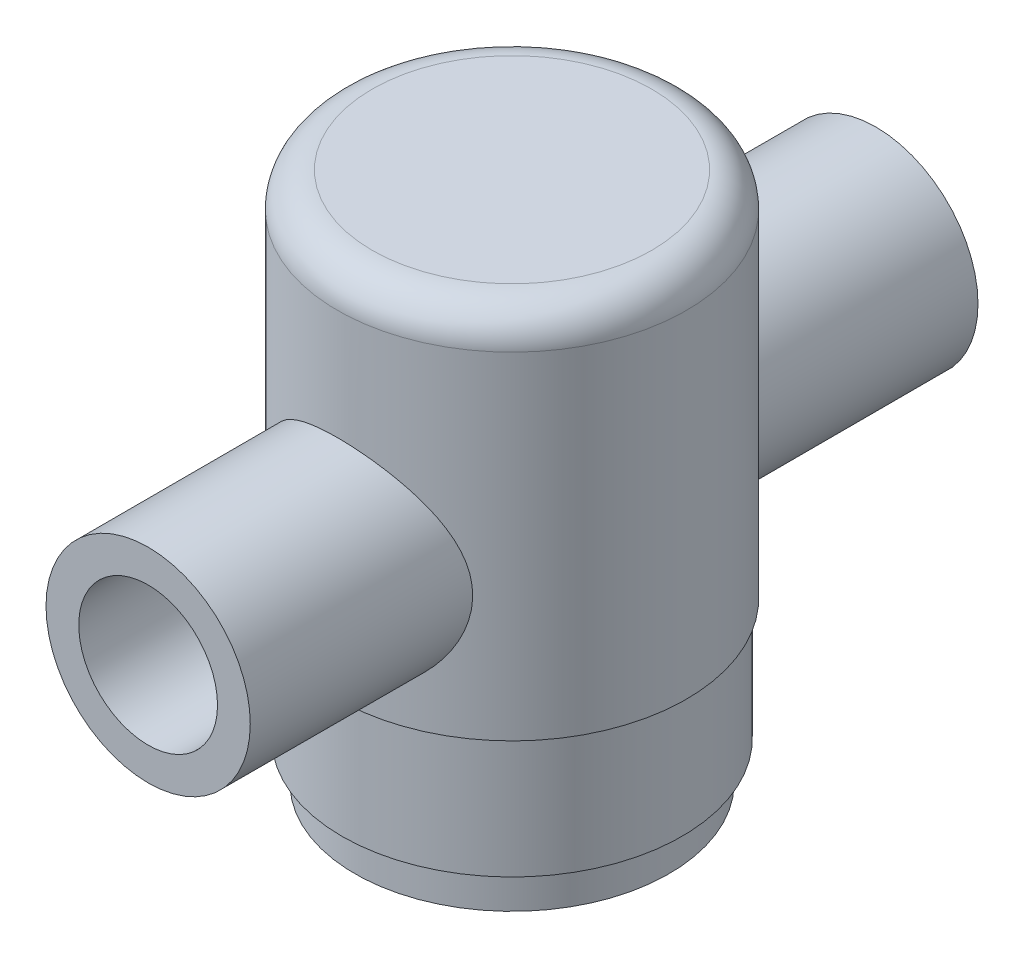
ISO-10303-21;
HEADER;
FILE_DESCRIPTION(('STEP AP214'),'2;1');
FILE_NAME('part.step','',(''),(''),'','','');
FILE_SCHEMA(('AUTOMOTIVE_DESIGN { 1 0 10303 214 1 1 1 1 }'));
ENDSEC;
DATA;
#1=APPLICATION_CONTEXT('core data for automotive mechanical design processes');
#2=APPLICATION_PROTOCOL_DEFINITION('international standard','automotive_design',2000,#1);
#3=PRODUCT_CONTEXT('',#1,'mechanical');
#4=PRODUCT('Part','Part','',(#3));
#5=PRODUCT_RELATED_PRODUCT_CATEGORY('part','',(#4));
#6=PRODUCT_DEFINITION_FORMATION('','',#4);
#7=PRODUCT_DEFINITION_CONTEXT('part definition',#1,'design');
#8=PRODUCT_DEFINITION('design','',#6,#7);
#9=PRODUCT_DEFINITION_SHAPE('','',#8);
#10=(LENGTH_UNIT() NAMED_UNIT(*) SI_UNIT(.MILLI.,.METRE.));
#11=(NAMED_UNIT(*) PLANE_ANGLE_UNIT() SI_UNIT($,.RADIAN.));
#12=(NAMED_UNIT(*) SI_UNIT($,.STERADIAN.) SOLID_ANGLE_UNIT());
#13=UNCERTAINTY_MEASURE_WITH_UNIT(LENGTH_MEASURE(1.E-05),#10,'distance_accuracy_value','');
#14=(GEOMETRIC_REPRESENTATION_CONTEXT(3) GLOBAL_UNCERTAINTY_ASSIGNED_CONTEXT((#13)) GLOBAL_UNIT_ASSIGNED_CONTEXT((#10,
#11,#12)) REPRESENTATION_CONTEXT('',''));
#15=CARTESIAN_POINT('',(0.,0.,0.));
#16=DIRECTION('',(0.,0.,1.));
#17=DIRECTION('',(1.,0.,0.));
#18=AXIS2_PLACEMENT_3D('',#15,#16,#17);
#19=CARTESIAN_POINT('',(0.,18.4404,-16.6497));
#20=DIRECTION('',(0.,0.,1.));
#21=DIRECTION('',(1.,0.,0.));
#22=AXIS2_PLACEMENT_3D('',#19,#20,#21);
#23=CYLINDRICAL_SURFACE('',#22,0.79375);
#24=CARTESIAN_POINT('',(0.,18.4404,8.5217));
#25=DIRECTION('',(0.,0.,1.));
#26=DIRECTION('',(1.,0.,0.));
#27=AXIS2_PLACEMENT_3D('',#24,#25,#26);
#28=CIRCLE('',#27,0.79375);
#29=CARTESIAN_POINT('',(0.79375,18.4404,8.5217));
#30=VERTEX_POINT('',#29);
#31=EDGE_CURVE('E108',#30,#30,#28,.F.);
#32=ORIENTED_EDGE('',*,*,#31,.F.);
#33=EDGE_LOOP('',(#32));
#34=FACE_BOUND('',#33,.T.);
#35=CARTESIAN_POINT('',(0.,18.4404,-8.5217));
#36=DIRECTION('',(0.,0.,-1.));
#37=DIRECTION('',(-1.,0.,0.));
#38=AXIS2_PLACEMENT_3D('',#35,#36,#37);
#39=CIRCLE('',#38,0.79375);
#40=CARTESIAN_POINT('',(-0.79375,18.4404,-8.5217));
#41=VERTEX_POINT('',#40);
#42=EDGE_CURVE('E49',#41,#41,#39,.F.);
#43=ORIENTED_EDGE('',*,*,#42,.F.);
#44=EDGE_LOOP('',(#43));
#45=FACE_BOUND('',#44,.T.);
#46=ADVANCED_FACE('F45',(#34,#45),#23,.F.);
#47=CARTESIAN_POINT('',(0.,0.,0.));
#48=DIRECTION('',(0.,-1.,0.));
#49=DIRECTION('',(0.,0.,-1.));
#50=AXIS2_PLACEMENT_3D('',#47,#48,#49);
#51=CYLINDRICAL_SURFACE('',#50,7.98195);
#52=CARTESIAN_POINT('',(-4.6736,18.4404,6.47062507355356));
#53=CARTESIAN_POINT('',(-4.67360004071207,18.3221364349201,6.47062498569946));
#54=CARTESIAN_POINT('',(-4.66910419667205,18.2038738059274,6.47387943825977));
#55=CARTESIAN_POINT('',(-4.65120218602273,17.9683806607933,6.48675295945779));
#56=CARTESIAN_POINT('',(-4.63779599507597,17.8511501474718,6.49637204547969));
#57=CARTESIAN_POINT('',(-4.60228279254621,17.6185893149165,6.52157891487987));
#58=CARTESIAN_POINT('',(-4.58016998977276,17.5032603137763,6.53717067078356));
#59=CARTESIAN_POINT('',(-4.52757619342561,17.275372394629,6.5737050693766));
#60=CARTESIAN_POINT('',(-4.49709128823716,17.1628147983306,6.59465021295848));
#61=CARTESIAN_POINT('',(-4.39414663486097,16.8319807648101,6.66407139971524));
#62=CARTESIAN_POINT('',(-4.30990350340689,16.61867871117,6.71935555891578));
#63=CARTESIAN_POINT('',(-4.1130541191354,16.2094761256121,6.84161373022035));
#64=CARTESIAN_POINT('',(-4.00043882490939,16.0135811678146,6.90859146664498));
#65=CARTESIAN_POINT('',(-3.73482652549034,15.6196963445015,7.05607999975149));
#66=CARTESIAN_POINT('',(-3.57866321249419,15.4240914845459,7.13725974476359));
#67=CARTESIAN_POINT('',(-3.23675681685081,15.0598188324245,7.29867295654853));
#68=CARTESIAN_POINT('',(-3.05099321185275,14.8911698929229,7.3789057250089));
#69=CARTESIAN_POINT('',(-2.74234453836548,14.6534138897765,7.49699393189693));
#70=CARTESIAN_POINT('',(-2.62865045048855,14.5735989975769,7.53770940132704));
#71=CARTESIAN_POINT('',(-2.39374084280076,14.4239444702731,7.61556380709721));
#72=CARTESIAN_POINT('',(-2.27252845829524,14.3541007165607,7.6527042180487));
#73=CARTESIAN_POINT('',(-2.02331400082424,14.2251400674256,7.72233531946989));
#74=CARTESIAN_POINT('',(-1.89531476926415,14.1660187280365,7.75482793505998));
#75=CARTESIAN_POINT('',(-1.63336897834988,14.0592316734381,7.81419561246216));
#76=CARTESIAN_POINT('',(-1.49942334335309,14.0115641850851,7.84107154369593));
#77=CARTESIAN_POINT('',(-1.23921777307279,13.9322249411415,7.88616942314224));
#78=CARTESIAN_POINT('',(-1.11338114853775,13.8994864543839,7.90495933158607));
#79=CARTESIAN_POINT('',(-0.858712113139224,13.844520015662,7.93666152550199));
#80=CARTESIAN_POINT('',(-0.729880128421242,13.8222905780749,7.94957464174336));
#81=CARTESIAN_POINT('',(-0.470425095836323,13.7886973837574,7.96913669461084));
#82=CARTESIAN_POINT('',(-0.339803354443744,13.7773260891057,7.97578997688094));
#83=CARTESIAN_POINT('',(-0.0779020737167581,13.7656117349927,7.9826443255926));
#84=CARTESIAN_POINT('',(0.0533774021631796,13.7652676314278,7.98284600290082));
#85=CARTESIAN_POINT('',(0.299796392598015,13.7749940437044,7.97715432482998));
#86=CARTESIAN_POINT('',(0.415003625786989,13.7838342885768,7.97198096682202));
#87=CARTESIAN_POINT('',(0.644163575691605,13.8099687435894,7.95674365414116));
#88=CARTESIAN_POINT('',(0.75811589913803,13.8272655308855,7.94667820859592));
#89=CARTESIAN_POINT('',(0.983905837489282,13.8700978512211,7.9218902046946));
#90=CARTESIAN_POINT('',(1.09574415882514,13.8956305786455,7.90716923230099));
#91=CARTESIAN_POINT('',(1.31665281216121,13.9546385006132,7.87340249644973));
#92=CARTESIAN_POINT('',(1.42572205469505,13.9881167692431,7.85435505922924));
#93=CARTESIAN_POINT('',(1.74930030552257,14.1004965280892,7.7910107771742));
#94=CARTESIAN_POINT('',(1.95871795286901,14.1910615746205,7.74067967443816));
#95=CARTESIAN_POINT('',(2.35957148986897,14.3998334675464,7.62807042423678));
#96=CARTESIAN_POINT('',(2.55100236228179,14.5180479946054,7.56578895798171));
#97=CARTESIAN_POINT('',(2.93445646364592,14.7943602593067,7.42608661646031));
#98=CARTESIAN_POINT('',(3.12395989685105,14.9554973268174,7.34774743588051));
#99=CARTESIAN_POINT('',(3.47479739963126,15.3051402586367,7.18850055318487));
#100=CARTESIAN_POINT('',(3.63609469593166,15.4936812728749,7.10758965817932));
#101=CARTESIAN_POINT('',(3.94351527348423,15.9171696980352,6.9421762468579));
#102=CARTESIAN_POINT('',(4.08614051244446,16.1549273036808,6.8582234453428));
#103=CARTESIAN_POINT('',(4.26786082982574,16.5306198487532,6.74551760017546));
#104=CARTESIAN_POINT('',(4.32305566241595,16.6589949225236,6.71015950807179));
#105=CARTESIAN_POINT('',(4.42210257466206,16.9214482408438,6.6453004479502));
#106=CARTESIAN_POINT('',(4.46595886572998,17.0555243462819,6.61579730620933));
#107=CARTESIAN_POINT('',(4.56137614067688,17.3998326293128,6.55059793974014));
#108=CARTESIAN_POINT('',(4.60500912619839,17.6132851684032,6.51970787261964));
#109=CARTESIAN_POINT('',(4.66203059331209,18.0459900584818,6.47906429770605));
#110=CARTESIAN_POINT('',(4.67545099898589,18.2652360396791,6.4692884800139));
#111=CARTESIAN_POINT('',(4.67133536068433,18.7034992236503,6.47226042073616));
#112=CARTESIAN_POINT('',(4.6537697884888,18.9225160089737,6.4850296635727));
#113=CARTESIAN_POINT('',(4.58866351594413,19.3538392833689,6.531249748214));
#114=CARTESIAN_POINT('',(4.54110001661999,19.5661405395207,6.56471631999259));
#115=CARTESIAN_POINT('',(4.41793404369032,19.9803411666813,6.64822473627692));
#116=CARTESIAN_POINT('',(4.34215958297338,20.1821678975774,6.69836804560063));
#117=CARTESIAN_POINT('',(4.16519394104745,20.5709807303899,6.80981611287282));
#118=CARTESIAN_POINT('',(4.06399277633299,20.7579609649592,6.87112525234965));
#119=CARTESIAN_POINT('',(3.81880485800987,21.1460850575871,7.01080926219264));
#120=CARTESIAN_POINT('',(3.67044176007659,21.3440615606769,7.09029980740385));
#121=CARTESIAN_POINT('',(3.34435183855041,21.7143446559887,7.2498108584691));
#122=CARTESIAN_POINT('',(3.16659873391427,21.8866280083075,7.32983177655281));
#123=CARTESIAN_POINT('',(2.86916511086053,22.1322166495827,7.4493381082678));
#124=CARTESIAN_POINT('',(2.75856981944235,22.2155978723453,7.49109884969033));
#125=CARTESIAN_POINT('',(2.52963889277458,22.3726658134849,7.57146905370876));
#126=CARTESIAN_POINT('',(2.41130627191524,22.4463562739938,7.6100797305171));
#127=CARTESIAN_POINT('',(2.16756019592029,22.5833166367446,7.68305876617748));
#128=CARTESIAN_POINT('',(2.04214897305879,22.6465897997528,7.71742845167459));
#129=CARTESIAN_POINT('',(1.78502078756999,22.7619836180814,7.78092226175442));
#130=CARTESIAN_POINT('',(1.65330470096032,22.8141058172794,7.81004711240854));
#131=CARTESIAN_POINT('',(1.39503354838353,22.9028643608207,7.860110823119));
#132=CARTESIAN_POINT('',(1.2688731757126,22.9403895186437,7.8815100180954));
#133=CARTESIAN_POINT('',(1.01303226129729,23.0047943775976,7.91845867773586));
#134=CARTESIAN_POINT('',(0.883352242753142,23.0316756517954,7.93400900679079));
#135=CARTESIAN_POINT('',(0.621686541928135,23.0743618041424,7.95878689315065));
#136=CARTESIAN_POINT('',(0.489702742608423,23.0901753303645,7.96801938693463));
#137=CARTESIAN_POINT('',(0.224577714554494,23.1104932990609,7.97989291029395));
#138=CARTESIAN_POINT('',(0.0914366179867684,23.1149990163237,7.98253468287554));
#139=CARTESIAN_POINT('',(-0.158040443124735,23.1127784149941,7.98123496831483));
#140=CARTESIAN_POINT('',(-0.274395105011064,23.107386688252,7.97807569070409));
#141=CARTESIAN_POINT('',(-0.506170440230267,23.0879645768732,7.96672975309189));
#142=CARTESIAN_POINT('',(-0.621590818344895,23.0739315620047,7.9585415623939));
#143=CARTESIAN_POINT('',(-0.850590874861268,23.0374062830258,7.93733162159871));
#144=CARTESIAN_POINT('',(-0.964171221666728,23.01491716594,7.9243116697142));
#145=CARTESIAN_POINT('',(-1.18879335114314,22.9617550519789,7.89374278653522));
#146=CARTESIAN_POINT('',(-1.29983413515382,22.9310788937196,7.87619210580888));
#147=CARTESIAN_POINT('',(-1.62655346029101,22.8277327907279,7.81757099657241));
#148=CARTESIAN_POINT('',(-1.8375948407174,22.743457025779,7.77035889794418));
#149=CARTESIAN_POINT('',(-2.24258401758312,22.5469974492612,7.66331350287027));
#150=CARTESIAN_POINT('',(-2.4365275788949,22.4348067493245,7.60347709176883));
#151=CARTESIAN_POINT('',(-2.8248419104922,22.171841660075,7.46850167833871));
#152=CARTESIAN_POINT('',(-3.01692419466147,22.0181842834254,7.392403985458));
#153=CARTESIAN_POINT('',(-3.37417479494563,21.6834662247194,7.23633338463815));
#154=CARTESIAN_POINT('',(-3.539311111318,21.502373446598,7.1563560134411));
#155=CARTESIAN_POINT('',(-3.77338055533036,21.2013433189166,7.03435170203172));
#156=CARTESIAN_POINT('',(-3.85259263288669,21.0897168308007,6.99116297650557));
#157=CARTESIAN_POINT('',(-4.00131123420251,20.8592526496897,6.9071209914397));
#158=CARTESIAN_POINT('',(-4.07081531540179,20.7404131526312,6.86626832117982));
#159=CARTESIAN_POINT('',(-4.19944988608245,20.4961716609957,6.78835788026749));
#160=CARTESIAN_POINT('',(-4.25858781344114,20.3707744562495,6.75129739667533));
#161=CARTESIAN_POINT('',(-4.36586332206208,20.1140497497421,6.68242680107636));
#162=CARTESIAN_POINT('',(-4.41400886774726,19.9827266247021,6.65061289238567));
#163=CARTESIAN_POINT('',(-4.49182500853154,19.7365201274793,6.5982471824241));
#164=CARTESIAN_POINT('',(-4.5232217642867,19.622391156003,6.57670694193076));
#165=CARTESIAN_POINT('',(-4.57738570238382,19.3912687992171,6.53912497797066));
#166=CARTESIAN_POINT('',(-4.60015788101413,19.2742771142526,6.52308007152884));
#167=CARTESIAN_POINT('',(-4.6367270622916,19.0383414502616,6.4971372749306));
#168=CARTESIAN_POINT('',(-4.65053320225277,18.9193995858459,6.48723312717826));
#169=CARTESIAN_POINT('',(-4.66896960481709,18.6804381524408,6.4739771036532));
#170=CARTESIAN_POINT('',(-4.67359995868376,18.5604185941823,6.4706251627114));
#171=CARTESIAN_POINT('',(-4.6736,18.4404,6.47062507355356));
#172=B_SPLINE_CURVE_WITH_KNOTS('',3,(#52,#53,#54,#55,#56,#57,#58,#59,#60,#61,#62,#63,#64,#65,
#66,#67,#68,#69,#70,#71,#72,#73,#74,#75,#76,#77,#78,#79,#80,#81,#82,#83,#84,#85,#86,#87,#88,#89,
#90,#91,#92,#93,#94,#95,#96,#97,#98,#99,#100,#101,#102,#103,#104,#105,#106,#107,#108,#109,#110,
#111,#112,#113,#114,#115,#116,#117,#118,#119,#120,#121,#122,#123,#124,#125,#126,#127,#128,#129,
#130,#131,#132,#133,#134,#135,#136,#137,#138,#139,#140,#141,#142,#143,#144,#145,#146,#147,#148,
#149,#150,#151,#152,#153,#154,#155,#156,#157,#158,#159,#160,#161,#162,#163,#164,#165,#166,#167,
#168,#169,#170,#171),.UNSPECIFIED.,.T.,.F.,(4,2,2,2,2,2,2,2,2,2,2,2,2,2,2,2,2,2,2,2,2,2,2,2,2,2,
2,2,2,2,2,2,2,2,2,2,2,2,2,2,2,2,2,2,2,2,2,2,2,2,2,2,2,2,2,2,2,2,2,4),(0.,0.354660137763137,
0.70932124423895,1.06421865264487,1.41928215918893,2.12378075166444,2.82850413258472,
3.6148461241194,4.40173569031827,4.8355139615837,5.26911253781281,5.70253099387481,
6.13588231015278,6.52945028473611,6.92296260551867,7.31620154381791,7.70940324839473,
8.05597361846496,8.40264967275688,8.74920775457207,9.09590013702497,9.79372697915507,
10.4917478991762,11.2709399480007,12.0511404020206,12.9152569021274,13.3471160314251,
13.7788145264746,14.4358563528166,15.0922035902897,15.7491766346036,16.4066495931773,
17.0681982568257,17.7300070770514,18.5065903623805,19.2838718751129,19.7173851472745,
20.1507305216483,20.5839399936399,21.0170894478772,21.4165691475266,21.815989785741,
22.2150979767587,22.614161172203,22.9633024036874,23.3125499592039,23.6616676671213,
24.010920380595,24.7040976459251,25.3974461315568,26.1668782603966,26.9372175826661,
27.3673587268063,27.7976079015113,28.2275470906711,28.6571737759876,29.0176775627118,
29.37797218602,29.7378990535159,30.0978223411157),.UNSPECIFIED.);
#173=CARTESIAN_POINT('',(-4.6736,18.4404,6.47062507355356));
#174=VERTEX_POINT('',#173);
#175=EDGE_CURVE('E55',#174,#174,#172,.T.);
#176=ORIENTED_EDGE('',*,*,#175,.F.);
#177=EDGE_LOOP('',(#176));
#178=FACE_BOUND('',#177,.T.);
#179=CARTESIAN_POINT('',(0.,28.1559,0.));
#180=DIRECTION('',(0.,-1.,0.));
#181=DIRECTION('',(0.,0.,-1.));
#182=AXIS2_PLACEMENT_3D('',#179,#180,#181);
#183=CIRCLE('',#182,7.98195);
#184=CARTESIAN_POINT('',(0.,28.1559,-7.98195));
#185=VERTEX_POINT('',#184);
#186=EDGE_CURVE('E229',#185,#185,#183,.T.);
#187=ORIENTED_EDGE('',*,*,#186,.T.);
#188=EDGE_LOOP('',(#187));
#189=FACE_BOUND('',#188,.T.);
#190=CARTESIAN_POINT('',(0.,12.7508,0.));
#191=DIRECTION('',(0.,-1.,0.));
#192=DIRECTION('',(0.,0.,-1.));
#193=AXIS2_PLACEMENT_3D('',#190,#191,#192);
#194=CIRCLE('',#193,7.98195);
#195=CARTESIAN_POINT('',(0.,12.7508,-7.98195));
#196=VERTEX_POINT('',#195);
#197=EDGE_CURVE('E237',#196,#196,#194,.T.);
#198=ORIENTED_EDGE('',*,*,#197,.F.);
#199=EDGE_LOOP('',(#198));
#200=FACE_BOUND('',#199,.T.);
#201=CARTESIAN_POINT('',(0.,23.114,-7.98195));
#202=CARTESIAN_POINT('',(0.120058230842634,23.1139991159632,-7.98194919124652));
#203=CARTESIAN_POINT('',(0.240160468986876,23.1093661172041,-7.97923403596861));
#204=CARTESIAN_POINT('',(0.479466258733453,23.0908912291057,-7.96843791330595));
#205=CARTESIAN_POINT('',(0.598669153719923,23.0770431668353,-7.96035334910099));
#206=CARTESIAN_POINT('',(0.835463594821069,23.0402827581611,-7.93899778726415));
#207=CARTESIAN_POINT('',(0.953051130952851,23.0173510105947,-7.92571568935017));
#208=CARTESIAN_POINT('',(1.18554863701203,22.9627093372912,-7.8942872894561));
#209=CARTESIAN_POINT('',(1.30045743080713,22.9309956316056,-7.87613889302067));
#210=CARTESIAN_POINT('',(1.52619456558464,22.8593602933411,-7.83551735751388));
#211=CARTESIAN_POINT('',(1.63704163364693,22.8194840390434,-7.81306817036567));
#212=CARTESIAN_POINT('',(1.8547005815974,22.7318340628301,-7.76428203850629));
#213=CARTESIAN_POINT('',(1.96151090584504,22.6840573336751,-7.73794361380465));
#214=CARTESIAN_POINT('',(2.27488821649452,22.5296009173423,-7.65395591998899));
#215=CARTESIAN_POINT('',(2.47470490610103,22.4116974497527,-7.59127735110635));
#216=CARTESIAN_POINT('',(2.86686163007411,22.1397037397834,-7.45245907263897));
#217=CARTESIAN_POINT('',(3.05753965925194,21.9835739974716,-7.37566483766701));
#218=CARTESIAN_POINT('',(3.41165149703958,21.6440559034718,-7.21870630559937));
#219=CARTESIAN_POINT('',(3.57505086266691,21.4606336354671,-7.13853790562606));
#220=CARTESIAN_POINT('',(3.88901802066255,21.0467671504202,-6.97295197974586));
#221=CARTESIAN_POINT('',(4.03592680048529,20.8133390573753,-6.88799690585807));
#222=CARTESIAN_POINT('',(4.28783383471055,20.3201257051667,-6.73408486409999));
#223=CARTESIAN_POINT('',(4.39289807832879,20.0603827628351,-6.66510277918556));
#224=CARTESIAN_POINT('',(4.53687962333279,19.5832875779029,-6.56764719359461));
#225=CARTESIAN_POINT('',(4.58547409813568,19.3700189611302,-6.53349541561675));
#226=CARTESIAN_POINT('',(4.65233909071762,18.9365985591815,-6.48606335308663));
#227=CARTESIAN_POINT('',(4.6706445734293,18.7164550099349,-6.47275900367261));
#228=CARTESIAN_POINT('',(4.67589766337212,18.2752332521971,-6.46896620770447));
#229=CARTESIAN_POINT('',(4.66279382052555,18.0541541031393,-6.47851519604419));
#230=CARTESIAN_POINT('',(4.60592730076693,17.6179454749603,-6.51905811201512));
#231=CARTESIAN_POINT('',(4.56214254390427,17.4028203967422,-6.55006748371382));
#232=CARTESIAN_POINT('',(4.44663190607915,16.9855645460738,-6.62901016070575));
#233=CARTESIAN_POINT('',(4.37513361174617,16.7833431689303,-6.67680532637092));
#234=CARTESIAN_POINT('',(4.20673493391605,16.3931782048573,-6.78416178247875));
#235=CARTESIAN_POINT('',(4.10982502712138,16.2052400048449,-6.84372748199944));
#236=CARTESIAN_POINT('',(3.87464709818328,15.815560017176,-6.97997474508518));
#237=CARTESIAN_POINT('',(3.73217033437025,15.6167799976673,-7.05785196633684));
#238=CARTESIAN_POINT('',(3.41822599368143,15.2438887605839,-7.21512724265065));
#239=CARTESIAN_POINT('',(3.24673216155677,15.0698001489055,-7.29452661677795));
#240=CARTESIAN_POINT('',(2.95813994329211,14.8195003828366,-7.41442305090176));
#241=CARTESIAN_POINT('',(2.8499601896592,14.7337279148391,-7.45677693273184));
#242=CARTESIAN_POINT('',(2.62573809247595,14.5716594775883,-7.53865008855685));
#243=CARTESIAN_POINT('',(2.50969890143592,14.4953597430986,-7.5781704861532));
#244=CARTESIAN_POINT('',(2.27032768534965,14.3529130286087,-7.65329198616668));
#245=CARTESIAN_POINT('',(2.14699514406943,14.2867667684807,-7.68889281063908));
#246=CARTESIAN_POINT('',(1.89385935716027,14.1654127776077,-7.75512215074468));
#247=CARTESIAN_POINT('',(1.76406013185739,14.1101983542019,-7.78575370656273));
#248=CARTESIAN_POINT('',(1.50764938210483,14.0146806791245,-7.83929348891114));
#249=CARTESIAN_POINT('',(1.38139394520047,13.9736332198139,-7.86257830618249));
#250=CARTESIAN_POINT('',(1.12502995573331,13.9022799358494,-7.90333246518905));
#251=CARTESIAN_POINT('',(0.994923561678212,13.8719682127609,-7.92080499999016));
#252=CARTESIAN_POINT('',(0.731997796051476,13.8225436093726,-7.94941383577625));
#253=CARTESIAN_POINT('',(0.599180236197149,13.8034234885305,-7.96055423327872));
#254=CARTESIAN_POINT('',(0.332009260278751,13.7766757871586,-7.97616404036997));
#255=CARTESIAN_POINT('',(0.197656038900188,13.7690467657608,-7.98063428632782));
#256=CARTESIAN_POINT('',(-0.0539294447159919,13.7656423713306,-7.98262799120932));
#257=CARTESIAN_POINT('',(-0.171139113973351,13.7684674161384,-7.9809716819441));
#258=CARTESIAN_POINT('',(-0.404869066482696,13.7828973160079,-7.97253319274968));
#259=CARTESIAN_POINT('',(-0.521389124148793,13.7945048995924,-7.96574941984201));
#260=CARTESIAN_POINT('',(-0.752797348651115,13.826349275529,-7.94721862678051));
#261=CARTESIAN_POINT('',(-0.867686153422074,13.8465825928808,-7.93547360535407));
#262=CARTESIAN_POINT('',(-1.09510078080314,13.8954201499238,-7.90730300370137));
#263=CARTESIAN_POINT('',(-1.20762567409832,13.924027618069,-7.89087561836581));
#264=CARTESIAN_POINT('',(-1.53670571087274,14.0208256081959,-7.8357378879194));
#265=CARTESIAN_POINT('',(-1.74895132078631,14.1005858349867,-7.79081481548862));
#266=CARTESIAN_POINT('',(-2.15697740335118,14.2882256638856,-7.6878745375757));
#267=CARTESIAN_POINT('',(-2.3527542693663,14.3961114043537,-7.62985447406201));
#268=CARTESIAN_POINT('',(-2.74447752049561,14.6495813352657,-7.49842169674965));
#269=CARTESIAN_POINT('',(-2.93831246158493,14.7979236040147,-7.42403475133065));
#270=CARTESIAN_POINT('',(-3.29982499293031,15.1218571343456,-7.27058142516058));
#271=CARTESIAN_POINT('',(-3.4674716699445,15.2974801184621,-7.19150966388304));
#272=CARTESIAN_POINT('',(-3.79263088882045,15.6958821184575,-7.02599484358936));
#273=CARTESIAN_POINT('',(-3.9464646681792,15.9217955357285,-6.93981708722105));
#274=CARTESIAN_POINT('',(-4.21384413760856,16.4005498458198,-6.78080473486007));
#275=CARTESIAN_POINT('',(-4.32743867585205,16.6533576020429,-6.70795401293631));
#276=CARTESIAN_POINT('',(-4.48957165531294,17.1235584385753,-6.60019992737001));
#277=CARTESIAN_POINT('',(-4.54685775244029,17.3368272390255,-6.56050072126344));
#278=CARTESIAN_POINT('',(-4.63083740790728,17.7719514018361,-6.50150580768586));
#279=CARTESIAN_POINT('',(-4.65756961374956,17.9937955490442,-6.48218432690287));
#280=CARTESIAN_POINT('',(-4.67895955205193,18.4404943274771,-6.46676646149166));
#281=CARTESIAN_POINT('',(-4.67352703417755,18.6653556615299,-6.47073542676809));
#282=CARTESIAN_POINT('',(-4.63072259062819,19.1104788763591,-6.50142869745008));
#283=CARTESIAN_POINT('',(-4.59333139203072,19.3307378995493,-6.52816673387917));
#284=CARTESIAN_POINT('',(-4.49037668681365,19.7537952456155,-6.59937531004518));
#285=CARTESIAN_POINT('',(-4.42574423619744,19.9569257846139,-6.64325659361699));
#286=CARTESIAN_POINT('',(-4.2709877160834,20.3498049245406,-6.74378776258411));
#287=CARTESIAN_POINT('',(-4.18085402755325,20.5395484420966,-6.80044246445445));
#288=CARTESIAN_POINT('',(-3.96159545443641,20.9316455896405,-6.93079745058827));
#289=CARTESIAN_POINT('',(-3.8285930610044,21.1313979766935,-7.00577870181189));
#290=CARTESIAN_POINT('',(-3.5342368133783,21.5077771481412,-7.15878410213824));
#291=CARTESIAN_POINT('',(-3.37286053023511,21.6843854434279,-7.23681062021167));
#292=CARTESIAN_POINT('',(-3.09894391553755,21.9415118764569,-7.35662650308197));
#293=CARTESIAN_POINT('',(-2.99504430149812,22.0308165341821,-7.39963867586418));
#294=CARTESIAN_POINT('',(-2.77923902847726,22.2003439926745,-7.48336354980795));
#295=CARTESIAN_POINT('',(-2.66733631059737,22.2805701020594,-7.52407708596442));
#296=CARTESIAN_POINT('',(-2.43594332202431,22.4313655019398,-7.60214650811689));
#297=CARTESIAN_POINT('',(-2.31644657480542,22.5019263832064,-7.6394994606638));
#298=CARTESIAN_POINT('',(-2.07067543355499,22.6325581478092,-7.70974363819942));
#299=CARTESIAN_POINT('',(-1.94440503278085,22.6926351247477,-7.74263745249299));
#300=CARTESIAN_POINT('',(-1.69166789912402,22.7991555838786,-7.8016577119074));
#301=CARTESIAN_POINT('',(-1.56546358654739,22.8460894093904,-7.82802138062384));
#302=CARTESIAN_POINT('',(-1.3085656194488,22.9290966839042,-7.87503753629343));
#303=CARTESIAN_POINT('',(-1.17787462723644,22.9651764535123,-7.89569334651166));
#304=CARTESIAN_POINT('',(-0.913446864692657,23.0258662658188,-7.93062896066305));
#305=CARTESIAN_POINT('',(-0.779720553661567,23.0505108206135,-7.9449279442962));
#306=CARTESIAN_POINT('',(-0.510162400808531,23.0880615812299,-7.96677545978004));
#307=CARTESIAN_POINT('',(-0.374332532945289,23.1009781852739,-7.97432997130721));
#308=CARTESIAN_POINT('',(-0.198510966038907,23.1099514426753,-7.97958012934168));
#309=CARTESIAN_POINT('',(-0.15883105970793,23.1114691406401,-7.98046836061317));
#310=CARTESIAN_POINT('',(-0.0794357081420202,23.1134935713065,-7.98165343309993));
#311=CARTESIAN_POINT('',(-0.0397202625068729,23.1140002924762,-7.98195026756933));
#312=CARTESIAN_POINT('',(0.,23.114,-7.98195));
#313=B_SPLINE_CURVE_WITH_KNOTS('',3,(#201,#202,#203,#204,#205,#206,#207,#208,#209,#210,#211,
#212,#213,#214,#215,#216,#217,#218,#219,#220,#221,#222,#223,#224,#225,#226,#227,#228,#229,#230,
#231,#232,#233,#234,#235,#236,#237,#238,#239,#240,#241,#242,#243,#244,#245,#246,#247,#248,#249,
#250,#251,#252,#253,#254,#255,#256,#257,#258,#259,#260,#261,#262,#263,#264,#265,#266,#267,#268,
#269,#270,#271,#272,#273,#274,#275,#276,#277,#278,#279,#280,#281,#282,#283,#284,#285,#286,#287,
#288,#289,#290,#291,#292,#293,#294,#295,#296,#297,#298,#299,#300,#301,#302,#303,#304,#305,#306,
#307,#308,#309,#310,#311,#312),.UNSPECIFIED.,.T.,.F.,(4,2,2,2,2,2,2,2,2,2,2,2,2,2,2,2,2,2,2,2,2,
2,2,2,2,2,2,2,2,2,2,2,2,2,2,2,2,2,2,2,2,2,2,2,2,2,2,2,2,2,2,2,2,2,2,4),(0.,0.3601318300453,
0.720505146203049,1.08165234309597,1.44295522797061,1.80230155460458,2.16178497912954,
2.879791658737,3.65121195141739,4.42359901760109,5.28515367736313,6.14534422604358,
6.80665648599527,7.46720480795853,8.12883588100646,8.79094359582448,9.44772542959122,
10.1047537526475,10.8718480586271,11.6396401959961,12.0723946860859,12.5049766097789,
12.9375891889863,13.3699360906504,13.7737149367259,14.1772715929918,14.5805668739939,
14.9838115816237,15.3351431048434,15.6865838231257,16.037883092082,16.3893179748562,
17.0796162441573,17.7700652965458,18.5325174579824,19.2958629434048,20.1515433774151,
21.0061814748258,21.6764629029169,22.3458955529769,23.0172074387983,23.6889244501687,
24.3393388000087,24.9899988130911,25.7414720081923,26.4935419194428,26.9238863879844,
27.3540735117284,27.7846325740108,28.2149405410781,28.6259634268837,29.0367464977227,
29.4462816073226,29.8554532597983,29.9745985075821,30.0937451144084),.UNSPECIFIED.);
#314=CARTESIAN_POINT('',(0.,23.114,-7.98195));
#315=VERTEX_POINT('',#314);
#316=EDGE_CURVE('E10',#315,#315,#313,.T.);
#317=ORIENTED_EDGE('',*,*,#316,.F.);
#318=EDGE_LOOP('',(#317));
#319=FACE_BOUND('',#318,.T.);
#320=ADVANCED_FACE('F78',(#178,#189,#200,#319),#51,.T.);
#321=CARTESIAN_POINT('',(0.,0.,0.));
#322=DIRECTION('',(0.,-1.,0.));
#323=DIRECTION('',(0.,0.,-1.));
#324=AXIS2_PLACEMENT_3D('',#321,#322,#323);
#325=CYLINDRICAL_SURFACE('',#324,3.175);
#326=CARTESIAN_POINT('',(0.,5.4356,0.));
#327=DIRECTION('',(0.,-1.,0.));
#328=DIRECTION('',(0.,0.,-1.));
#329=AXIS2_PLACEMENT_3D('',#326,#327,#328);
#330=CIRCLE('',#329,3.175);
#331=CARTESIAN_POINT('',(0.,5.4356,-3.175));
#332=VERTEX_POINT('',#331);
#333=EDGE_CURVE('E178',#332,#332,#330,.T.);
#334=ORIENTED_EDGE('',*,*,#333,.T.);
#335=EDGE_LOOP('',(#334));
#336=FACE_BOUND('',#335,.T.);
#337=CARTESIAN_POINT('',(0.,13.7668,-3.175));
#338=CARTESIAN_POINT('',(0.158846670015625,13.7668060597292,-3.1749933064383));
#339=CARTESIAN_POINT('',(0.31773754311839,13.7749721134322,-3.16300759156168));
#340=CARTESIAN_POINT('',(0.630446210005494,13.8068443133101,-3.11580182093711));
#341=CARTESIAN_POINT('',(0.784260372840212,13.8305613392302,-3.08056549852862));
#342=CARTESIAN_POINT('',(1.08179669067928,13.8912005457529,-2.98905816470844));
#343=CARTESIAN_POINT('',(1.22556404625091,13.9280583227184,-2.93288968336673));
#344=CARTESIAN_POINT('',(1.5010029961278,14.0120493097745,-2.8019452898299));
#345=CARTESIAN_POINT('',(1.63267324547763,14.0591836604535,-2.72716731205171));
#346=CARTESIAN_POINT('',(1.89302097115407,14.1648408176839,-2.55413457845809));
#347=CARTESIAN_POINT('',(2.02046047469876,14.2239952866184,-2.45441108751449));
#348=CARTESIAN_POINT('',(2.2579623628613,14.3462544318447,-2.23788026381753));
#349=CARTESIAN_POINT('',(2.36799886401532,14.4093648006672,-2.12104797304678));
#350=CARTESIAN_POINT('',(2.58612691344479,14.5450770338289,-1.85133762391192));
#351=CARTESIAN_POINT('',(2.69091344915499,14.6175302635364,-1.69569201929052));
#352=CARTESIAN_POINT('',(2.87278274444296,14.7522490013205,-1.3649917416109));
#353=CARTESIAN_POINT('',(2.94991315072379,14.814531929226,-1.18997113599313));
#354=CARTESIAN_POINT('',(3.05425497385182,14.9024247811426,-0.87782625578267));
#355=CARTESIAN_POINT('',(3.08949093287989,14.933432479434,-0.744920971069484));
#356=CARTESIAN_POINT('',(3.14256809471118,14.9809058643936,-0.473249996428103));
#357=CARTESIAN_POINT('',(3.16044055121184,14.9973976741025,-0.334495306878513));
#358=CARTESIAN_POINT('',(3.17765435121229,15.0132712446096,-0.0541604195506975));
#359=CARTESIAN_POINT('',(3.17690875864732,15.0125727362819,0.0874299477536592));
#360=CARTESIAN_POINT('',(3.15672678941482,14.9939848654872,0.368158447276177));
#361=CARTESIAN_POINT('',(3.13727685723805,14.9760830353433,0.507294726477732));
#362=CARTESIAN_POINT('',(3.08250548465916,14.9272916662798,0.772101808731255));
#363=CARTESIAN_POINT('',(3.04806251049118,14.8971263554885,0.898096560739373));
#364=CARTESIAN_POINT('',(2.965093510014,14.8274104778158,1.14260300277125));
#365=CARTESIAN_POINT('',(2.91655658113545,14.7878526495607,1.26110881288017));
#366=CARTESIAN_POINT('',(2.7798653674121,14.6820070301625,1.5455118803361));
#367=CARTESIAN_POINT('',(2.68393343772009,14.6120906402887,1.70634253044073));
#368=CARTESIAN_POINT('',(2.46644875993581,14.4684714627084,2.00796271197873));
#369=CARTESIAN_POINT('',(2.34484854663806,14.3947618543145,2.14871429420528));
#370=CARTESIAN_POINT('',(2.07660153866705,14.2506918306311,2.40905722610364));
#371=CARTESIAN_POINT('',(1.92974890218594,14.1803655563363,2.5284567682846));
#372=CARTESIAN_POINT('',(1.61383696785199,14.050975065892,2.7408410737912));
#373=CARTESIAN_POINT('',(1.4448245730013,13.9918876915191,2.8338803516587));
#374=CARTESIAN_POINT('',(1.12782010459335,13.9026278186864,2.97179338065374));
#375=CARTESIAN_POINT('',(0.983467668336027,13.8689494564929,3.02277153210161));
#376=CARTESIAN_POINT('',(0.686562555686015,13.8150496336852,3.10368740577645));
#377=CARTESIAN_POINT('',(0.534015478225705,13.7948191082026,3.13363930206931));
#378=CARTESIAN_POINT('',(0.224379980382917,13.7695983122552,3.17090957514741));
#379=CARTESIAN_POINT('',(0.0672781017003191,13.7646591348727,3.17815207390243));
#380=CARTESIAN_POINT('',(-0.245969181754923,13.7706490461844,3.1693332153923));
#381=CARTESIAN_POINT('',(-0.402114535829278,13.781578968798,3.15327063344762));
#382=CARTESIAN_POINT('',(-0.700479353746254,13.8172763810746,3.10027642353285));
#383=CARTESIAN_POINT('',(-0.842998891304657,13.8412833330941,3.06449062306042));
#384=CARTESIAN_POINT('',(-1.11958448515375,13.9006756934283,2.97461249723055));
#385=CARTESIAN_POINT('',(-1.25364898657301,13.9360631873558,2.92051681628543));
#386=CARTESIAN_POINT('',(-1.52148026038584,14.0189917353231,2.79098852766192));
#387=CARTESIAN_POINT('',(-1.65434556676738,14.0672843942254,2.71418383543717));
#388=CARTESIAN_POINT('',(-1.90588956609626,14.1708959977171,2.54387910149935));
#389=CARTESIAN_POINT('',(-2.02455725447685,14.2262203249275,2.45036624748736));
#390=CARTESIAN_POINT('',(-2.26522802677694,14.3498629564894,2.23160752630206));
#391=CARTESIAN_POINT('',(-2.38446641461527,14.4188064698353,2.10367006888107));
#392=CARTESIAN_POINT('',(-2.60082108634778,14.5552207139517,1.82944683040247));
#393=CARTESIAN_POINT('',(-2.69792800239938,14.6226908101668,1.6831533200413));
#394=CARTESIAN_POINT('',(-2.85599092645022,14.7398414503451,1.39533716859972));
#395=CARTESIAN_POINT('',(-2.9201102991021,14.7906894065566,1.25603651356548));
#396=CARTESIAN_POINT('',(-3.02835005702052,14.8799811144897,0.966196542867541));
#397=CARTESIAN_POINT('',(-3.07250972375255,14.918449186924,0.815679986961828));
#398=CARTESIAN_POINT('',(-3.13298570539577,14.9722136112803,0.531537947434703));
#399=CARTESIAN_POINT('',(-3.15267014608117,14.990267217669,0.399165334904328));
#400=CARTESIAN_POINT('',(-3.17508932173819,15.0108810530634,0.131833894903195));
#401=CARTESIAN_POINT('',(-3.17783885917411,15.0134548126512,-0.00312257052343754));
#402=CARTESIAN_POINT('',(-3.16621838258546,15.0027195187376,-0.271536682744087));
#403=CARTESIAN_POINT('',(-3.15185900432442,14.9894203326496,-0.404995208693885));
#404=CARTESIAN_POINT('',(-3.10699033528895,14.9489771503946,-0.667061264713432));
#405=CARTESIAN_POINT('',(-3.07645843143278,14.9218137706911,-0.795661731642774));
#406=CARTESIAN_POINT('',(-2.98855536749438,14.846602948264,-1.08579317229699));
#407=CARTESIAN_POINT('',(-2.92571406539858,14.7946502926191,-1.24463837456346));
#408=CARTESIAN_POINT('',(-2.77751686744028,14.6805231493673,-1.54743203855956));
#409=CARTESIAN_POINT('',(-2.69212706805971,14.6183333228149,-1.6913576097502));
#410=CARTESIAN_POINT('',(-2.49895857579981,14.489257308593,-1.96584633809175));
#411=CARTESIAN_POINT('',(-2.39076539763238,14.4223019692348,-2.09608380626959));
#412=CARTESIAN_POINT('',(-2.15427125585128,14.290708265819,-2.33845583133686));
#413=CARTESIAN_POINT('',(-2.02596461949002,14.2260705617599,-2.45058526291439));
#414=CARTESIAN_POINT('',(-1.81100298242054,14.1311086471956,-2.60962964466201));
#415=CARTESIAN_POINT('',(-1.73066465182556,14.0981382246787,-2.66362270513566));
#416=CARTESIAN_POINT('',(-1.56445026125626,14.0355270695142,-2.76451857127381));
#417=CARTESIAN_POINT('',(-1.47857701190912,14.0058846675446,-2.81142493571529));
#418=CARTESIAN_POINT('',(-1.301879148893,13.9508349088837,-2.89747719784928));
#419=CARTESIAN_POINT('',(-1.21106178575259,13.9254215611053,-2.9366340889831));
#420=CARTESIAN_POINT('',(-1.02510545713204,13.8796027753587,-3.00660207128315));
#421=CARTESIAN_POINT('',(-0.929968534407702,13.8591949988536,-3.03741706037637));
#422=CARTESIAN_POINT('',(-0.698824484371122,13.8173350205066,-3.10025381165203));
#423=CARTESIAN_POINT('',(-0.561181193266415,13.7985043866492,-3.12817458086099));
#424=CARTESIAN_POINT('',(-0.282369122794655,13.7732370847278,-3.16554632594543));
#425=CARTESIAN_POINT('',(-0.141202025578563,13.7667946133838,-3.1750059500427));
#426=CARTESIAN_POINT('',(0.,13.7668,-3.175));
#427=B_SPLINE_CURVE_WITH_KNOTS('',3,(#337,#338,#339,#340,#341,#342,#343,#344,#345,#346,#347,
#348,#349,#350,#351,#352,#353,#354,#355,#356,#357,#358,#359,#360,#361,#362,#363,#364,#365,#366,
#367,#368,#369,#370,#371,#372,#373,#374,#375,#376,#377,#378,#379,#380,#381,#382,#383,#384,#385,
#386,#387,#388,#389,#390,#391,#392,#393,#394,#395,#396,#397,#398,#399,#400,#401,#402,#403,#404,
#405,#406,#407,#408,#409,#410,#411,#412,#413,#414,#415,#416,#417,#418,#419,#420,#421,#422,#423,
#424,#425,#426),.UNSPECIFIED.,.T.,.F.,(4,2,2,2,2,2,2,2,2,2,2,2,2,2,2,2,2,2,2,2,2,2,2,2,2,2,2,2,
2,2,2,2,2,2,2,2,2,2,2,2,2,2,2,2,4),(0.,0.475981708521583,0.952296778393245,1.42630878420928,
1.90037342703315,2.4153324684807,2.93105034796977,3.531704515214,4.13131883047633,
4.55252316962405,4.9729679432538,5.39537632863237,5.81809107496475,6.21881153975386,
6.61984281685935,7.21641385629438,7.81409787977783,8.41690727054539,9.01846076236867,
9.48673095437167,9.95468517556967,10.4242012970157,10.8937420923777,11.3385085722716,
11.7833566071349,12.2641918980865,12.745397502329,13.3071257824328,13.8690913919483,
14.3520324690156,14.8340189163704,15.237336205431,15.640300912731,16.0430152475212,
16.4462941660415,16.9790690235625,17.5126495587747,18.0569259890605,18.601356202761,
18.9077480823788,19.2139855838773,19.5197854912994,19.8254422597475,20.2487503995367,
20.671860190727),.UNSPECIFIED.);
#428=CARTESIAN_POINT('',(0.,13.7668,-3.175));
#429=VERTEX_POINT('',#428);
#430=EDGE_CURVE('E96',#429,#429,#427,.T.);
#431=ORIENTED_EDGE('',*,*,#430,.F.);
#432=EDGE_LOOP('',(#431));
#433=FACE_BOUND('',#432,.T.);
#434=ADVANCED_FACE('F114',(#336,#433),#325,.F.);
#435=CARTESIAN_POINT('',(0.,29.7434,0.));
#436=DIRECTION('',(0.,-1.,0.));
#437=DIRECTION('',(0.,0.,-1.));
#438=AXIS2_PLACEMENT_3D('',#435,#436,#437);
#439=PLANE('',#438);
#440=CARTESIAN_POINT('',(0.,29.7434,0.));
#441=DIRECTION('',(0.,-1.,0.));
#442=DIRECTION('',(0.,0.,-1.));
#443=AXIS2_PLACEMENT_3D('',#440,#441,#442);
#444=CIRCLE('',#443,6.39445);
#445=CARTESIAN_POINT('',(0.,29.7434,-6.39445));
#446=VERTEX_POINT('',#445);
#447=EDGE_CURVE('E226',#446,#446,#444,.F.);
#448=ORIENTED_EDGE('',*,*,#447,.T.);
#449=EDGE_LOOP('',(#448));
#450=FACE_BOUND('',#449,.T.);
#451=ADVANCED_FACE('F134',(#450),#439,.F.);
#452=CARTESIAN_POINT('',(-7.98195,12.7508,0.));
#453=DIRECTION('',(0.,1.,0.));
#454=DIRECTION('',(0.,0.,1.));
#455=AXIS2_PLACEMENT_3D('',#452,#453,#454);
#456=PLANE('',#455);
#457=CARTESIAN_POINT('',(0.,12.7508,0.));
#458=DIRECTION('',(0.,-1.,0.));
#459=DIRECTION('',(0.,0.,-1.));
#460=AXIS2_PLACEMENT_3D('',#457,#458,#459);
#461=CIRCLE('',#460,7.77777493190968);
#462=CARTESIAN_POINT('',(0.,12.7508,-7.77777493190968));
#463=VERTEX_POINT('',#462);
#464=EDGE_CURVE('E245',#463,#463,#461,.T.);
#465=ORIENTED_EDGE('',*,*,#464,.F.);
#466=EDGE_LOOP('',(#465));
#467=FACE_BOUND('',#466,.T.);
#468=ORIENTED_EDGE('',*,*,#197,.T.);
#469=EDGE_LOOP('',(#468));
#470=FACE_BOUND('',#469,.T.);
#471=ADVANCED_FACE('F131',(#467,#470),#456,.F.);
#472=CARTESIAN_POINT('',(0.,0.,0.));
#473=DIRECTION('',(0.,-1.,0.));
#474=DIRECTION('',(0.,0.,-1.));
#475=AXIS2_PLACEMENT_3D('',#472,#473,#474);
#476=CYLINDRICAL_SURFACE('',#475,7.77777493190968);
#477=CARTESIAN_POINT('',(0.,7.2136,0.));
#478=DIRECTION('',(0.,-1.,0.));
#479=DIRECTION('',(0.,0.,-1.));
#480=AXIS2_PLACEMENT_3D('',#477,#478,#479);
#481=CIRCLE('',#480,7.77777493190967);
#482=CARTESIAN_POINT('',(0.,7.2136,-7.77777493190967));
#483=VERTEX_POINT('',#482);
#484=EDGE_CURVE('E248',#483,#483,#481,.T.);
#485=ORIENTED_EDGE('',*,*,#484,.F.);
#486=EDGE_LOOP('',(#485));
#487=FACE_BOUND('',#486,.T.);
#488=ORIENTED_EDGE('',*,*,#464,.T.);
#489=EDGE_LOOP('',(#488));
#490=FACE_BOUND('',#489,.T.);
#491=ADVANCED_FACE('F128',(#487,#490),#476,.T.);
#492=CARTESIAN_POINT('',(-7.77777493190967,7.2136,0.));
#493=DIRECTION('',(0.,1.,0.));
#494=DIRECTION('',(0.,0.,1.));
#495=AXIS2_PLACEMENT_3D('',#492,#493,#494);
#496=PLANE('',#495);
#497=CARTESIAN_POINT('',(0.,7.2136,0.));
#498=DIRECTION('',(0.,-1.,0.));
#499=DIRECTION('',(0.,0.,-1.));
#500=AXIS2_PLACEMENT_3D('',#497,#498,#499);
#501=CIRCLE('',#500,7.1882);
#502=CARTESIAN_POINT('',(0.,7.2136,-7.1882));
#503=VERTEX_POINT('',#502);
#504=EDGE_CURVE('E254',#503,#503,#501,.T.);
#505=ORIENTED_EDGE('',*,*,#504,.F.);
#506=EDGE_LOOP('',(#505));
#507=FACE_BOUND('',#506,.T.);
#508=ORIENTED_EDGE('',*,*,#484,.T.);
#509=EDGE_LOOP('',(#508));
#510=FACE_BOUND('',#509,.T.);
#511=ADVANCED_FACE('F124',(#507,#510),#496,.F.);
#512=CARTESIAN_POINT('',(0.,0.,0.));
#513=DIRECTION('',(0.,-1.,0.));
#514=DIRECTION('',(0.,0.,-1.));
#515=AXIS2_PLACEMENT_3D('',#512,#513,#514);
#516=CYLINDRICAL_SURFACE('',#515,7.1882);
#517=CARTESIAN_POINT('',(0.,5.4356,0.));
#518=DIRECTION('',(0.,-1.,0.));
#519=DIRECTION('',(0.,0.,-1.));
#520=AXIS2_PLACEMENT_3D('',#517,#518,#519);
#521=CIRCLE('',#520,7.1882);
#522=CARTESIAN_POINT('',(0.,5.4356,-7.1882));
#523=VERTEX_POINT('',#522);
#524=EDGE_CURVE('E258',#523,#523,#521,.T.);
#525=ORIENTED_EDGE('',*,*,#524,.F.);
#526=EDGE_LOOP('',(#525));
#527=FACE_BOUND('',#526,.T.);
#528=ORIENTED_EDGE('',*,*,#504,.T.);
#529=EDGE_LOOP('',(#528));
#530=FACE_BOUND('',#529,.T.);
#531=ADVANCED_FACE('F120',(#527,#530),#516,.T.);
#532=CARTESIAN_POINT('',(-7.1882,5.4356,0.));
#533=DIRECTION('',(0.,1.,0.));
#534=DIRECTION('',(0.,0.,1.));
#535=AXIS2_PLACEMENT_3D('',#532,#533,#534);
#536=PLANE('',#535);
#537=ORIENTED_EDGE('',*,*,#333,.F.);
#538=EDGE_LOOP('',(#537));
#539=FACE_BOUND('',#538,.T.);
#540=ORIENTED_EDGE('',*,*,#524,.T.);
#541=EDGE_LOOP('',(#540));
#542=FACE_BOUND('',#541,.T.);
#543=ADVANCED_FACE('F116',(#539,#542),#536,.F.);
#544=CARTESIAN_POINT('',(0.,28.1559,0.));
#545=DIRECTION('',(0.,-1.,0.));
#546=DIRECTION('',(0.,0.,-1.));
#547=AXIS2_PLACEMENT_3D('',#544,#545,#546);
#548=TOROIDAL_SURFACE('',#547,6.39445,1.5875);
#549=ORIENTED_EDGE('',*,*,#447,.F.);
#550=EDGE_LOOP('',(#549));
#551=FACE_BOUND('',#550,.T.);
#552=ORIENTED_EDGE('',*,*,#186,.F.);
#553=EDGE_LOOP('',(#552));
#554=FACE_BOUND('',#553,.T.);
#555=ADVANCED_FACE('F47',(#551,#554),#548,.T.);
#556=CARTESIAN_POINT('',(0.,18.4404,16.6497));
#557=DIRECTION('',(0.,0.,-1.));
#558=DIRECTION('',(-1.,0.,0.));
#559=AXIS2_PLACEMENT_3D('',#556,#557,#558);
#560=CYLINDRICAL_SURFACE('',#559,4.6736);
#561=ORIENTED_EDGE('',*,*,#430,.T.);
#562=EDGE_LOOP('',(#561));
#563=FACE_BOUND('',#562,.T.);
#564=ADVANCED_FACE('F89',(#563),#560,.T.);
#565=CARTESIAN_POINT('',(0.,18.4404,16.6497));
#566=DIRECTION('',(0.,0.,1.));
#567=DIRECTION('',(1.,0.,0.));
#568=AXIS2_PLACEMENT_3D('',#565,#566,#567);
#569=PLANE('',#568);
#570=CARTESIAN_POINT('',(0.,18.4404,16.6497));
#571=DIRECTION('',(0.,0.,1.));
#572=DIRECTION('',(1.,0.,0.));
#573=AXIS2_PLACEMENT_3D('',#570,#571,#572);
#574=CIRCLE('',#573,3.175);
#575=CARTESIAN_POINT('',(3.175,18.4404,16.6497));
#576=VERTEX_POINT('',#575);
#577=EDGE_CURVE('E167',#576,#576,#574,.T.);
#578=ORIENTED_EDGE('',*,*,#577,.F.);
#579=EDGE_LOOP('',(#578));
#580=FACE_BOUND('',#579,.T.);
#581=CARTESIAN_POINT('',(0.,18.4404,16.6497));
#582=DIRECTION('',(0.,0.,1.));
#583=DIRECTION('',(1.,0.,0.));
#584=AXIS2_PLACEMENT_3D('',#581,#582,#583);
#585=CIRCLE('',#584,4.6736);
#586=CARTESIAN_POINT('',(4.6736,18.4404,16.6497));
#587=VERTEX_POINT('',#586);
#588=EDGE_CURVE('E170',#587,#587,#585,.T.);
#589=ORIENTED_EDGE('',*,*,#588,.T.);
#590=EDGE_LOOP('',(#589));
#591=FACE_BOUND('',#590,.T.);
#592=ADVANCED_FACE('F154',(#580,#591),#569,.T.);
#593=ORIENTED_EDGE('',*,*,#588,.F.);
#594=EDGE_LOOP('',(#593));
#595=FACE_BOUND('',#594,.T.);
#596=ORIENTED_EDGE('',*,*,#175,.T.);
#597=EDGE_LOOP('',(#596));
#598=FACE_BOUND('',#597,.T.);
#599=ADVANCED_FACE('F87',(#595,#598),#560,.T.);
#600=CARTESIAN_POINT('',(0.,18.4404,-16.6497));
#601=DIRECTION('',(0.,0.,1.));
#602=DIRECTION('',(1.,0.,0.));
#603=AXIS2_PLACEMENT_3D('',#600,#601,#602);
#604=CIRCLE('',#603,4.6736);
#605=CARTESIAN_POINT('',(4.6736,18.4404,-16.6497));
#606=VERTEX_POINT('',#605);
#607=EDGE_CURVE('E172',#606,#606,#604,.T.);
#608=ORIENTED_EDGE('',*,*,#607,.T.);
#609=EDGE_LOOP('',(#608));
#610=FACE_BOUND('',#609,.T.);
#611=ORIENTED_EDGE('',*,*,#316,.T.);
#612=EDGE_LOOP('',(#611));
#613=FACE_BOUND('',#612,.T.);
#614=ADVANCED_FACE('F81',(#610,#613),#560,.T.);
#615=CARTESIAN_POINT('',(0.,18.4404,-16.6497));
#616=DIRECTION('',(0.,0.,1.));
#617=DIRECTION('',(1.,0.,0.));
#618=AXIS2_PLACEMENT_3D('',#615,#616,#617);
#619=PLANE('',#618);
#620=CARTESIAN_POINT('',(0.,18.4404,-16.6497));
#621=DIRECTION('',(0.,0.,-1.));
#622=DIRECTION('',(-1.,0.,0.));
#623=AXIS2_PLACEMENT_3D('',#620,#621,#622);
#624=CIRCLE('',#623,3.175);
#625=CARTESIAN_POINT('',(-3.175,18.4404,-16.6497));
#626=VERTEX_POINT('',#625);
#627=EDGE_CURVE('E186',#626,#626,#624,.T.);
#628=ORIENTED_EDGE('',*,*,#627,.F.);
#629=EDGE_LOOP('',(#628));
#630=FACE_BOUND('',#629,.T.);
#631=ORIENTED_EDGE('',*,*,#607,.F.);
#632=EDGE_LOOP('',(#631));
#633=FACE_BOUND('',#632,.T.);
#634=ADVANCED_FACE('F86',(#630,#633),#619,.F.);
#635=CARTESIAN_POINT('',(0.,18.4404,8.5217));
#636=DIRECTION('',(0.,0.,1.));
#637=DIRECTION('',(1.,0.,0.));
#638=AXIS2_PLACEMENT_3D('',#635,#636,#637);
#639=PLANE('',#638);
#640=CARTESIAN_POINT('',(0.,18.4404,8.5217));
#641=DIRECTION('',(0.,0.,1.));
#642=DIRECTION('',(1.,0.,0.));
#643=AXIS2_PLACEMENT_3D('',#640,#641,#642);
#644=CIRCLE('',#643,3.175);
#645=CARTESIAN_POINT('',(3.175,18.4404,8.5217));
#646=VERTEX_POINT('',#645);
#647=EDGE_CURVE('E183',#646,#646,#644,.T.);
#648=ORIENTED_EDGE('',*,*,#647,.T.);
#649=EDGE_LOOP('',(#648));
#650=FACE_BOUND('',#649,.T.);
#651=ORIENTED_EDGE('',*,*,#31,.T.);
#652=EDGE_LOOP('',(#651));
#653=FACE_BOUND('',#652,.T.);
#654=ADVANCED_FACE('F210',(#650,#653),#639,.T.);
#655=CARTESIAN_POINT('',(0.,18.4404,8.5217));
#656=DIRECTION('',(0.,0.,1.));
#657=DIRECTION('',(1.,0.,0.));
#658=AXIS2_PLACEMENT_3D('',#655,#656,#657);
#659=CYLINDRICAL_SURFACE('',#658,3.175);
#660=ORIENTED_EDGE('',*,*,#647,.F.);
#661=EDGE_LOOP('',(#660));
#662=FACE_BOUND('',#661,.T.);
#663=ORIENTED_EDGE('',*,*,#577,.T.);
#664=EDGE_LOOP('',(#663));
#665=FACE_BOUND('',#664,.T.);
#666=ADVANCED_FACE('F152',(#662,#665),#659,.F.);
#667=CARTESIAN_POINT('',(0.,18.4404,-8.5217));
#668=DIRECTION('',(0.,0.,-1.));
#669=DIRECTION('',(-1.,0.,0.));
#670=AXIS2_PLACEMENT_3D('',#667,#668,#669);
#671=PLANE('',#670);
#672=CARTESIAN_POINT('',(0.,18.4404,-8.5217));
#673=DIRECTION('',(0.,0.,-1.));
#674=DIRECTION('',(-1.,0.,0.));
#675=AXIS2_PLACEMENT_3D('',#672,#673,#674);
#676=CIRCLE('',#675,3.175);
#677=CARTESIAN_POINT('',(-3.175,18.4404,-8.5217));
#678=VERTEX_POINT('',#677);
#679=EDGE_CURVE('E190',#678,#678,#676,.T.);
#680=ORIENTED_EDGE('',*,*,#679,.T.);
#681=EDGE_LOOP('',(#680));
#682=FACE_BOUND('',#681,.T.);
#683=ORIENTED_EDGE('',*,*,#42,.T.);
#684=EDGE_LOOP('',(#683));
#685=FACE_BOUND('',#684,.T.);
#686=ADVANCED_FACE('F200',(#682,#685),#671,.T.);
#687=CARTESIAN_POINT('',(0.,18.4404,-8.5217));
#688=DIRECTION('',(0.,0.,-1.));
#689=DIRECTION('',(-1.,0.,0.));
#690=AXIS2_PLACEMENT_3D('',#687,#688,#689);
#691=CYLINDRICAL_SURFACE('',#690,3.175);
#692=ORIENTED_EDGE('',*,*,#679,.F.);
#693=EDGE_LOOP('',(#692));
#694=FACE_BOUND('',#693,.T.);
#695=ORIENTED_EDGE('',*,*,#627,.T.);
#696=EDGE_LOOP('',(#695));
#697=FACE_BOUND('',#696,.T.);
#698=ADVANCED_FACE('F202',(#694,#697),#691,.F.);
#699=CLOSED_SHELL('',(#46,#320,#434,#451,#471,#491,#511,#531,#543,#555,#564,#592,#599,#614,#634,
#654,#666,#686,#698));
#700=CARTESIAN_POINT('',(0.,23.114,-3.175));
#701=CARTESIAN_POINT('',(-0.158846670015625,23.1139939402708,-3.1749933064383));
#702=CARTESIAN_POINT('',(-0.31773754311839,23.1058278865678,-3.16300759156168));
#703=CARTESIAN_POINT('',(-0.630446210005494,23.0739556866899,-3.11580182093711));
#704=CARTESIAN_POINT('',(-0.784260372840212,23.0502386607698,-3.08056549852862));
#705=CARTESIAN_POINT('',(-1.08179669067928,22.9895994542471,-2.98905816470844));
#706=CARTESIAN_POINT('',(-1.22556404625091,22.9527416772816,-2.93288968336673));
#707=CARTESIAN_POINT('',(-1.5010029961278,22.8687506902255,-2.8019452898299));
#708=CARTESIAN_POINT('',(-1.63267324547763,22.8216163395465,-2.72716731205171));
#709=CARTESIAN_POINT('',(-1.89302097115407,22.7159591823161,-2.55413457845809));
#710=CARTESIAN_POINT('',(-2.02046047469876,22.6568047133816,-2.45441108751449));
#711=CARTESIAN_POINT('',(-2.2579623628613,22.5345455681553,-2.23788026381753));
#712=CARTESIAN_POINT('',(-2.36799886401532,22.4714351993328,-2.12104797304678));
#713=CARTESIAN_POINT('',(-2.58612691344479,22.3357229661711,-1.85133762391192));
#714=CARTESIAN_POINT('',(-2.69091344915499,22.2632697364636,-1.69569201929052));
#715=CARTESIAN_POINT('',(-2.87278274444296,22.1285509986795,-1.36499174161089));
#716=CARTESIAN_POINT('',(-2.94991315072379,22.066268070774,-1.18997113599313));
#717=CARTESIAN_POINT('',(-3.05425497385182,21.9783752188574,-0.87782625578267));
#718=CARTESIAN_POINT('',(-3.08949093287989,21.947367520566,-0.744920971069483));
#719=CARTESIAN_POINT('',(-3.14256809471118,21.8998941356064,-0.473249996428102));
#720=CARTESIAN_POINT('',(-3.16044055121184,21.8834023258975,-0.334495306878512));
#721=CARTESIAN_POINT('',(-3.17765435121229,21.8675287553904,-0.0541604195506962));
#722=CARTESIAN_POINT('',(-3.17690875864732,21.8682272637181,0.0874299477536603));
#723=CARTESIAN_POINT('',(-3.15672678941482,21.8868151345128,0.368158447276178));
#724=CARTESIAN_POINT('',(-3.13727685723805,21.9047169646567,0.507294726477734));
#725=CARTESIAN_POINT('',(-3.08250548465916,21.9535083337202,0.772101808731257));
#726=CARTESIAN_POINT('',(-3.04806251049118,21.9836736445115,0.898096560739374));
#727=CARTESIAN_POINT('',(-2.965093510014,22.0533895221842,1.14260300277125));
#728=CARTESIAN_POINT('',(-2.91655658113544,22.0929473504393,1.26110881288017));
#729=CARTESIAN_POINT('',(-2.77986536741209,22.1987929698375,1.54551188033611));
#730=CARTESIAN_POINT('',(-2.68393343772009,22.2687093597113,1.70634253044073));
#731=CARTESIAN_POINT('',(-2.46644875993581,22.4123285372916,2.00796271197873));
#732=CARTESIAN_POINT('',(-2.34484854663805,22.4860381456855,2.14871429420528));
#733=CARTESIAN_POINT('',(-2.07660153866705,22.6301081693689,2.40905722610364));
#734=CARTESIAN_POINT('',(-1.92974890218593,22.7004344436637,2.5284567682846));
#735=CARTESIAN_POINT('',(-1.61383696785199,22.829824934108,2.74084107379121));
#736=CARTESIAN_POINT('',(-1.4448245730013,22.8889123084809,2.83388035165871));
#737=CARTESIAN_POINT('',(-1.12782010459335,22.9781721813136,2.97179338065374));
#738=CARTESIAN_POINT('',(-0.983467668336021,23.0118505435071,3.02277153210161));
#739=CARTESIAN_POINT('',(-0.686562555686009,23.0657503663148,3.10368740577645));
#740=CARTESIAN_POINT('',(-0.534015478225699,23.0859808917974,3.13363930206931));
#741=CARTESIAN_POINT('',(-0.224379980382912,23.1112016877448,3.17090957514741));
#742=CARTESIAN_POINT('',(-0.0672781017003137,23.1161408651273,3.17815207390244));
#743=CARTESIAN_POINT('',(0.245969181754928,23.1101509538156,3.1693332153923));
#744=CARTESIAN_POINT('',(0.402114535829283,23.099221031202,3.15327063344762));
#745=CARTESIAN_POINT('',(0.700479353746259,23.0635236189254,3.10027642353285));
#746=CARTESIAN_POINT('',(0.842998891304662,23.0395166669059,3.06449062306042));
#747=CARTESIAN_POINT('',(1.11958448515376,22.9801243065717,2.97461249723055));
#748=CARTESIAN_POINT('',(1.25364898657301,22.9447368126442,2.92051681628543));
#749=CARTESIAN_POINT('',(1.52148026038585,22.8618082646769,2.79098852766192));
#750=CARTESIAN_POINT('',(1.65434556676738,22.8135156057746,2.71418383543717));
#751=CARTESIAN_POINT('',(1.90588956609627,22.7099040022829,2.54387910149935));
#752=CARTESIAN_POINT('',(2.02455725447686,22.6545796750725,2.45036624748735));
#753=CARTESIAN_POINT('',(2.26522802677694,22.5309370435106,2.23160752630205));
#754=CARTESIAN_POINT('',(2.38446641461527,22.4619935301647,2.10367006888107));
#755=CARTESIAN_POINT('',(2.60082108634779,22.3255792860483,1.82944683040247));
#756=CARTESIAN_POINT('',(2.69792800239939,22.2581091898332,1.68315332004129));
#757=CARTESIAN_POINT('',(2.85599092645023,22.1409585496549,1.39533716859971));
#758=CARTESIAN_POINT('',(2.92011029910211,22.0901105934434,1.25603651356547));
#759=CARTESIAN_POINT('',(3.02835005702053,22.0008188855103,0.966196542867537));
#760=CARTESIAN_POINT('',(3.07250972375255,21.962350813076,0.815679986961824));
#761=CARTESIAN_POINT('',(3.13298570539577,21.9085863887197,0.531537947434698));
#762=CARTESIAN_POINT('',(3.15267014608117,21.890532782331,0.399165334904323));
#763=CARTESIAN_POINT('',(3.17508932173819,21.8699189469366,0.13183389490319));
#764=CARTESIAN_POINT('',(3.17783885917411,21.8673451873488,-0.00312257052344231));
#765=CARTESIAN_POINT('',(3.16621838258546,21.8780804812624,-0.271536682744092));
#766=CARTESIAN_POINT('',(3.15185900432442,21.8913796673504,-0.40499520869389));
#767=CARTESIAN_POINT('',(3.10699033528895,21.9318228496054,-0.667061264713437));
#768=CARTESIAN_POINT('',(3.07645843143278,21.9589862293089,-0.795661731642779));
#769=CARTESIAN_POINT('',(2.98855536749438,22.034197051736,-1.08579317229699));
#770=CARTESIAN_POINT('',(2.92571406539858,22.0861497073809,-1.24463837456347));
#771=CARTESIAN_POINT('',(2.77751686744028,22.2002768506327,-1.54743203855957));
#772=CARTESIAN_POINT('',(2.6921270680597,22.2624666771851,-1.69135760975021));
#773=CARTESIAN_POINT('',(2.4989585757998,22.391542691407,-1.96584633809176));
#774=CARTESIAN_POINT('',(2.39076539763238,22.4584980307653,-2.0960838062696));
#775=CARTESIAN_POINT('',(2.15427125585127,22.590091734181,-2.33845583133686));
#776=CARTESIAN_POINT('',(2.02596461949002,22.6547294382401,-2.4505852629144));
#777=CARTESIAN_POINT('',(1.81100298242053,22.7496913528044,-2.60962964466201));
#778=CARTESIAN_POINT('',(1.73066465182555,22.7826617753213,-2.66362270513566));
#779=CARTESIAN_POINT('',(1.56445026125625,22.8452729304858,-2.76451857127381));
#780=CARTESIAN_POINT('',(1.47857701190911,22.8749153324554,-2.81142493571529));
#781=CARTESIAN_POINT('',(1.30187914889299,22.9299650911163,-2.89747719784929));
#782=CARTESIAN_POINT('',(1.21106178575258,22.9553784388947,-2.9366340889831));
#783=CARTESIAN_POINT('',(1.02510545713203,23.0011972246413,-3.00660207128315));
#784=CARTESIAN_POINT('',(0.929968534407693,23.0216050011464,-3.03741706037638));
#785=CARTESIAN_POINT('',(0.698824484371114,23.0634649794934,-3.10025381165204));
#786=CARTESIAN_POINT('',(0.561181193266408,23.0822956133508,-3.128174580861));
#787=CARTESIAN_POINT('',(0.28236912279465,23.1075629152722,-3.16554632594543));
#788=CARTESIAN_POINT('',(0.141202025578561,23.1140053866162,-3.1750059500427));
#789=CARTESIAN_POINT('',(0.,23.114,-3.175));
#790=B_SPLINE_CURVE_WITH_KNOTS('',3,(#700,#701,#702,#703,#704,#705,#706,#707,#708,#709,#710,
#711,#712,#713,#714,#715,#716,#717,#718,#719,#720,#721,#722,#723,#724,#725,#726,#727,#728,#729,
#730,#731,#732,#733,#734,#735,#736,#737,#738,#739,#740,#741,#742,#743,#744,#745,#746,#747,#748,
#749,#750,#751,#752,#753,#754,#755,#756,#757,#758,#759,#760,#761,#762,#763,#764,#765,#766,#767,
#768,#769,#770,#771,#772,#773,#774,#775,#776,#777,#778,#779,#780,#781,#782,#783,#784,#785,#786,
#787,#788,#789),.UNSPECIFIED.,.T.,.F.,(4,2,2,2,2,2,2,2,2,2,2,2,2,2,2,2,2,2,2,2,2,2,2,2,2,2,2,2,
2,2,2,2,2,2,2,2,2,2,2,2,2,2,2,2,4),(0.,0.475981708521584,0.952296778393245,1.42630878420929,
1.90037342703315,2.4153324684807,2.93105034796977,3.531704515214,4.13131883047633,
4.55252316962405,4.97296794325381,5.39537632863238,5.81809107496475,6.21881153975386,
6.61984281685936,7.21641385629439,7.81409787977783,8.41690727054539,9.01846076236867,
9.48673095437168,9.95468517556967,10.4242012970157,10.8937420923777,11.3385085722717,
11.7833566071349,12.2641918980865,12.745397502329,13.3071257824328,13.8690913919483,
14.3520324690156,14.8340189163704,15.237336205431,15.640300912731,16.0430152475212,
16.4462941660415,16.9790690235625,17.5126495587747,18.0569259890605,18.601356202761,
18.9077480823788,19.2139855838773,19.5197854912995,19.8254422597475,20.2487503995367,
20.671860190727),.UNSPECIFIED.);
#791=CARTESIAN_POINT('',(0.,23.114,-3.175));
#792=VERTEX_POINT('',#791);
#793=EDGE_CURVE('E64',#792,#792,#790,.T.);
#794=ORIENTED_EDGE('',*,*,#793,.T.);
#795=EDGE_LOOP('',(#794));
#796=FACE_BOUND('',#795,.T.);
#797=ADVANCED_FACE('F162',(#796),#560,.T.);
#798=CARTESIAN_POINT('',(-3.175,27.6479,0.));
#799=DIRECTION('',(0.,1.,0.));
#800=DIRECTION('',(0.,0.,1.));
#801=AXIS2_PLACEMENT_3D('',#798,#799,#800);
#802=PLANE('',#801);
#803=CARTESIAN_POINT('',(0.,27.6479,0.));
#804=DIRECTION('',(0.,-1.,0.));
#805=DIRECTION('',(0.,0.,-1.));
#806=AXIS2_PLACEMENT_3D('',#803,#804,#805);
#807=CIRCLE('',#806,3.175);
#808=CARTESIAN_POINT('',(0.,27.6479,-3.175));
#809=VERTEX_POINT('',#808);
#810=EDGE_CURVE('E76',#809,#809,#807,.T.);
#811=ORIENTED_EDGE('',*,*,#810,.T.);
#812=EDGE_LOOP('',(#811));
#813=FACE_BOUND('',#812,.T.);
#814=ADVANCED_FACE('F91',(#813),#802,.F.);
#815=ORIENTED_EDGE('',*,*,#810,.F.);
#816=EDGE_LOOP('',(#815));
#817=FACE_BOUND('',#816,.T.);
#818=ORIENTED_EDGE('',*,*,#793,.F.);
#819=EDGE_LOOP('',(#818));
#820=FACE_BOUND('',#819,.T.);
#821=ADVANCED_FACE('F109',(#817,#820),#325,.F.);
#822=CLOSED_SHELL('',(#797,#814,#821));
#823=ORIENTED_CLOSED_SHELL('',*,#822,.T.);
#824=BREP_WITH_VOIDS('B2',#699,(#823));
#825=ADVANCED_BREP_SHAPE_REPRESENTATION('',(#18,#824),#14);
#826=SHAPE_DEFINITION_REPRESENTATION(#9,#825);
ENDSEC;
END-ISO-10303-21;
